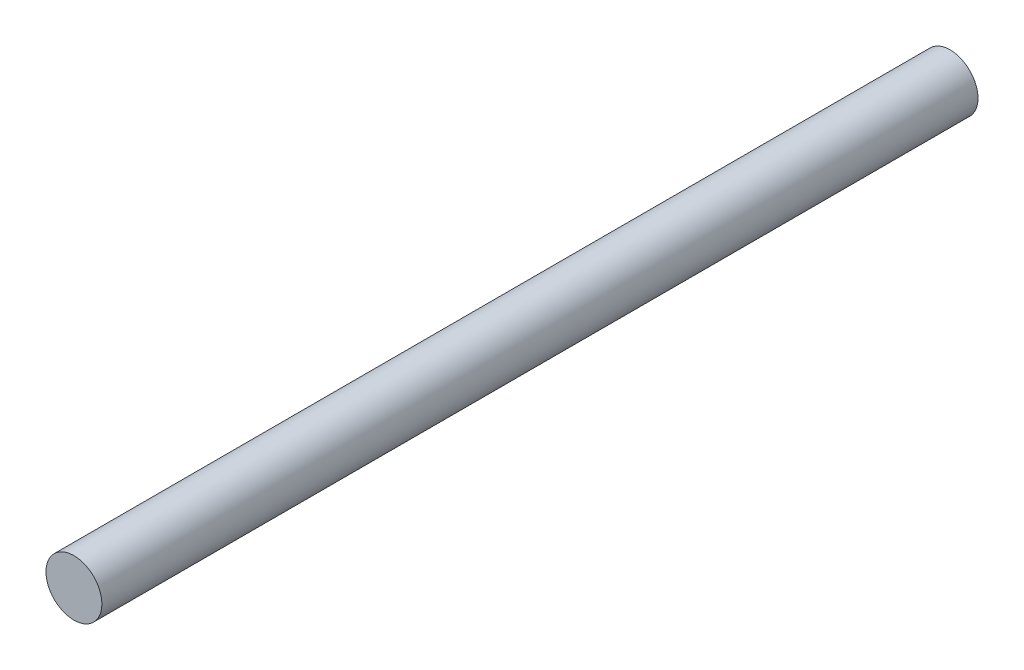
from build123d import *

# Parameters (mm, degrees)
ESQUISSE1_R        = 3
BOSS_EXTRU_1_DEPTH = 94


with BuildPart() as part:
    # Esquisse1 → Boss.-Extru.1 (new body)
    with BuildSketch(Plane.XY):
        Circle(ESQUISSE1_R)
    extrude(amount=BOSS_EXTRU_1_DEPTH)


solid = part.part
